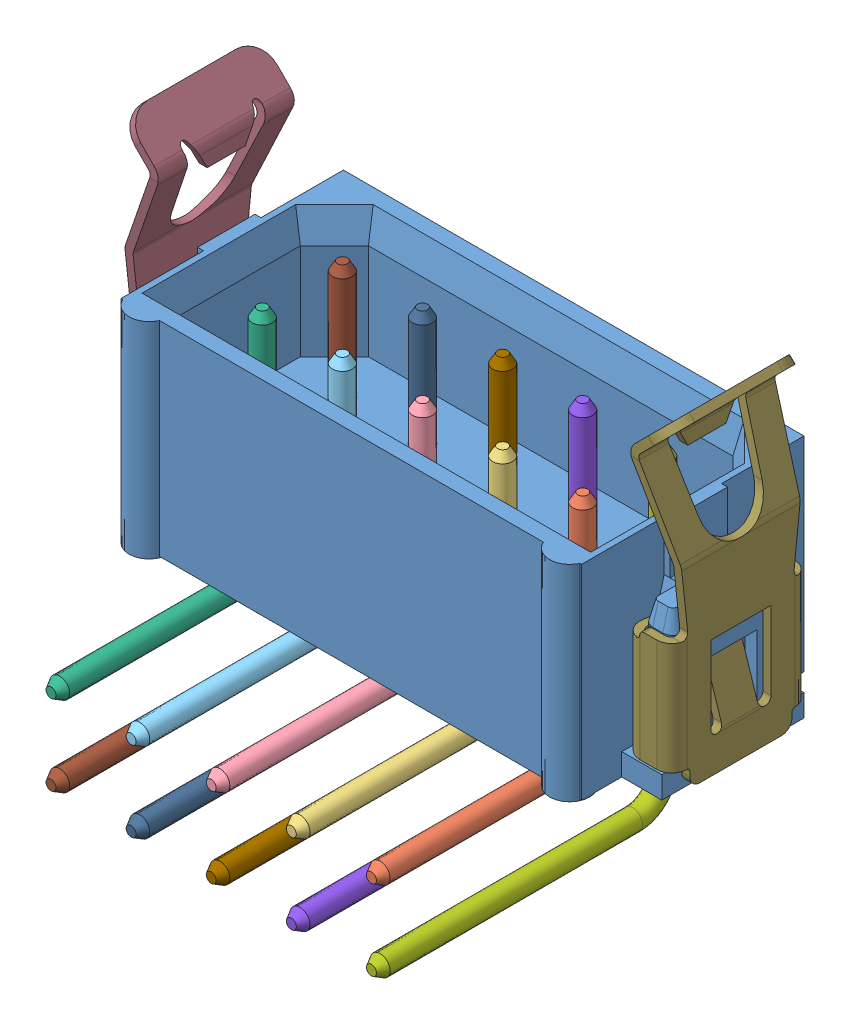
SolidWorks assembly m80-8511042_asm.SLDASM, configuration Default (file format 7000). Lengths in mm.
Overall size (13.9 11.1 9.05).
14 component instances, 13 part files, 0 mates.
Components (placement in the parent):
- M80-8681022-1: M80-8681022.sldasm [Default] at origin size (13.5 8.15 9.05)
  - M80-1021098_SEPARATE_ROWS-1: M80-1021098_SEPARATE_ROWS.sldprt [Default] at origin size (13.5 5.4 5.85)
  - M80-868-PIN1_4-1: M80-868-PIN1_4.sldprt [Default] at origin size (0.8 5.95 5.68)
  - M80-868-PIN1_1_2-1: M80-868-PIN1_1_2.sldprt [Default] at origin size (0.8 5.95 5.68)
  - M80-868-PIN1_2_1-1: M80-868-PIN1_2_1.sldprt [Default] at origin size (0.8 5.95 5.68)
  - M80-868-PIN1_3_1-1: M80-868-PIN1_3_1.sldprt [Default] at origin size (0.8 5.95 5.68)
  - M80-868-PIN1_4-1-1: M80-868-PIN1_4-1.sldprt [Default] at origin size (0.8 5.95 5.68)
  - M80-868-PIN2_4-1: M80-868-PIN2_4.sldprt [Default] at origin size (0.8 7.95 7.68)
  - M80-868-PIN2_1_2-1: M80-868-PIN2_1_2.sldprt [Default] at origin size (0.8 7.95 7.68)
  - M80-868-PIN2_2_1-1: M80-868-PIN2_2_1.sldprt [Default] at origin size (0.8 7.95 7.68)
  - M80-868-PIN2_3_1-1: M80-868-PIN2_3_1.sldprt [Default] at origin size (0.8 7.95 7.68)
  - M80-868-PIN2_4-1-1: M80-868-PIN2_4-1.sldprt [Default] at origin size (0.8 7.95 7.68)
- M80-001XXXX_7-1: M80-001XXXX_7.sldprt [Default] at origin size (1.2 7.95 3.45)
- M80-001XXXX_1_6-1: M80-001XXXX_1_6.sldprt [Default] at origin size (1.2 7.95 3.45)
